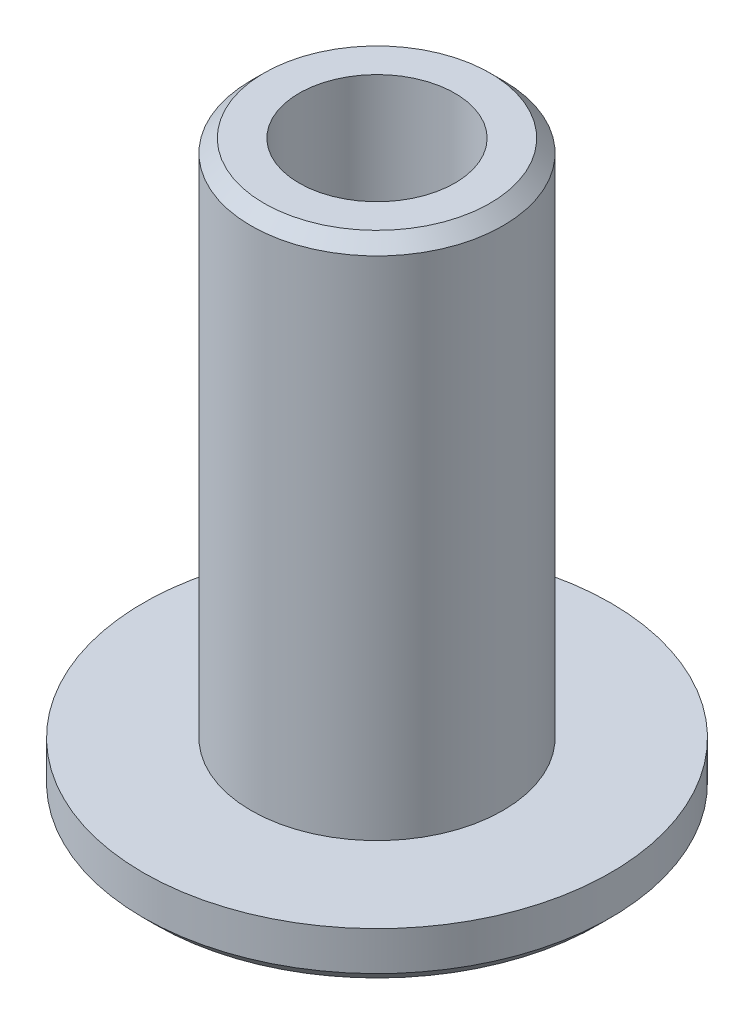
from build123d import *

# Parameters (mm, degrees)
SKIZZE1_R                       = 9
SKIZZE1_R_2                     = 3
AUFSATZ_LINEAR_AUSTRAGEN1_DEPTH = 2
SKIZZE2_R                       = 4.85
SKIZZE2_R_2                     = 3
AUFSATZ_LINEAR_AUSTRAGEN2_DEPTH = 20
FASE1_SIZE                      = 0.5


with BuildPart() as part:
    # Skizze1 → Aufsatz-Linear austragen1 (new body)
    with BuildSketch(Plane(origin=(0, 0, 0), x_dir=(1, 0, 0), z_dir=(0, 1, 0))):
        with Locations(Location((0, 0, 0), (0, 0, 270))):
            Circle(SKIZZE1_R)
        with Locations(Location((0, 0, 0), (0, 0, 270))):
            Circle(SKIZZE1_R_2, mode=Mode.SUBTRACT)
    extrude(amount=AUFSATZ_LINEAR_AUSTRAGEN1_DEPTH)

    # Skizze2 → Aufsatz-Linear austragen2 (add)
    with BuildSketch(Plane(origin=(0, 2, 0), x_dir=(1, 0, 0), z_dir=(0, 1, 0))):
        with Locations(Location((0, 0, 0), (0, 0, 270))):
            Circle(SKIZZE2_R)
        with Locations(Location((0, 0, 0), (0, 0, 270))):
            Circle(SKIZZE2_R_2, mode=Mode.SUBTRACT)
    extrude(amount=AUFSATZ_LINEAR_AUSTRAGEN2_DEPTH)

    # Fase1
    fase1_edges = [part.edges().sort_by_distance(p)[0] for p in [
        (0, 22, -4.85),
        (0, 0, -9),
    ]]
    chamfer(fase1_edges, length=FASE1_SIZE)


solid = part.part
